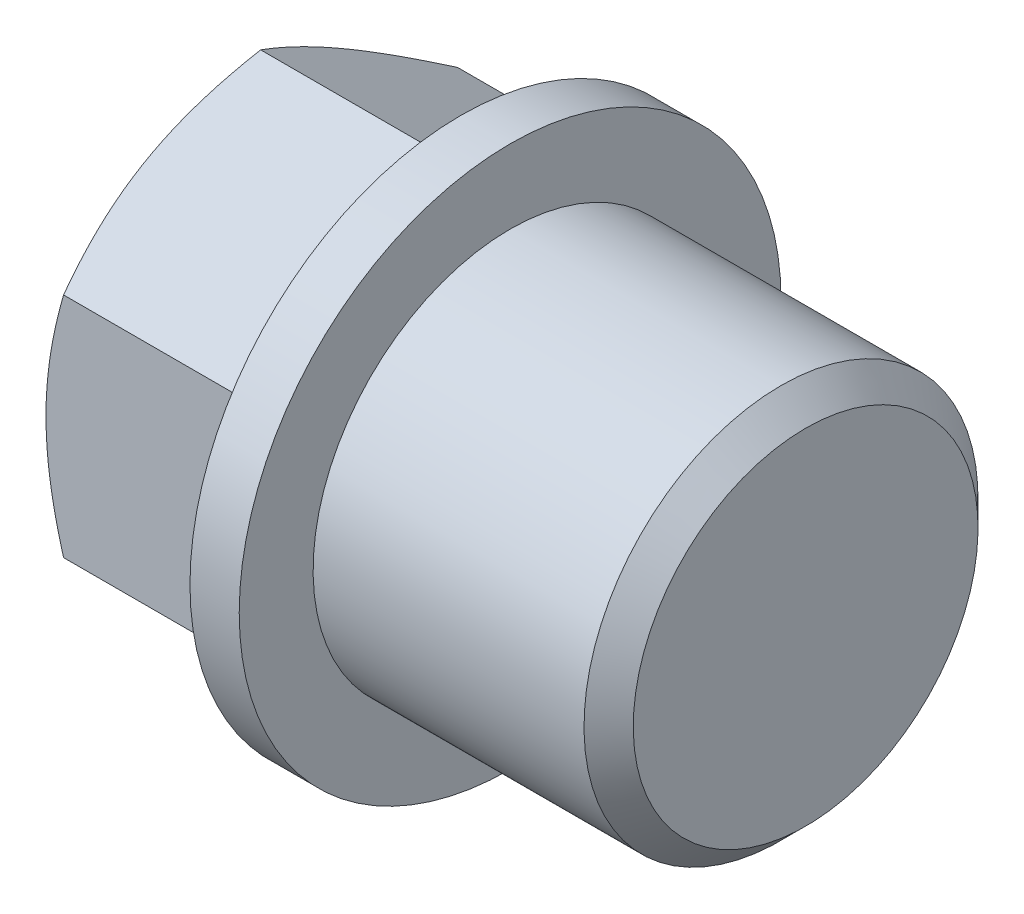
ISO-10303-21;
HEADER;
FILE_DESCRIPTION(('STEP AP214'),'2;1');
FILE_NAME('part.step','',(''),(''),'','','');
FILE_SCHEMA(('AUTOMOTIVE_DESIGN { 1 0 10303 214 1 1 1 1 }'));
ENDSEC;
DATA;
#1=APPLICATION_CONTEXT('core data for automotive mechanical design processes');
#2=APPLICATION_PROTOCOL_DEFINITION('international standard','automotive_design',2000,#1);
#3=PRODUCT_CONTEXT('',#1,'mechanical');
#4=PRODUCT('Part','Part','',(#3));
#5=PRODUCT_RELATED_PRODUCT_CATEGORY('part','',(#4));
#6=PRODUCT_DEFINITION_FORMATION('','',#4);
#7=PRODUCT_DEFINITION_CONTEXT('part definition',#1,'design');
#8=PRODUCT_DEFINITION('design','',#6,#7);
#9=PRODUCT_DEFINITION_SHAPE('','',#8);
#10=(LENGTH_UNIT() NAMED_UNIT(*) SI_UNIT(.MILLI.,.METRE.));
#11=(NAMED_UNIT(*) PLANE_ANGLE_UNIT() SI_UNIT($,.RADIAN.));
#12=(NAMED_UNIT(*) SI_UNIT($,.STERADIAN.) SOLID_ANGLE_UNIT());
#13=UNCERTAINTY_MEASURE_WITH_UNIT(LENGTH_MEASURE(1.E-05),#10,'distance_accuracy_value','');
#14=(GEOMETRIC_REPRESENTATION_CONTEXT(3) GLOBAL_UNCERTAINTY_ASSIGNED_CONTEXT((#13)) GLOBAL_UNIT_ASSIGNED_CONTEXT((#10,
#11,#12)) REPRESENTATION_CONTEXT('',''));
#15=CARTESIAN_POINT('',(0.,0.,0.));
#16=DIRECTION('',(0.,0.,1.));
#17=DIRECTION('',(1.,0.,0.));
#18=AXIS2_PLACEMENT_3D('',#15,#16,#17);
#19=CARTESIAN_POINT('',(10.,9.23759999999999,0.));
#20=DIRECTION('',(0.,0.866025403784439,0.5));
#21=DIRECTION('',(0.,-0.5,0.866025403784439));
#22=AXIS2_PLACEMENT_3D('',#19,#20,#21);
#23=PLANE('',#22);
#24=DIRECTION('',(-1.,0.,0.));
#25=VECTOR('',#24,1.);
#26=CARTESIAN_POINT('',(10.,9.23759999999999,0.));
#27=LINE('',#26,#25);
#28=CARTESIAN_POINT('',(10.,9.23759999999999,0.));
#29=VERTEX_POINT('',#28);
#30=CARTESIAN_POINT('',(1.8692292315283,9.23759999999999,0.));
#31=VERTEX_POINT('',#30);
#32=EDGE_CURVE('E108',#29,#31,#27,.T.);
#33=ORIENTED_EDGE('',*,*,#32,.T.);
#34=CARTESIAN_POINT('',(1.86929589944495,9.23771547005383,-0.000200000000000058));
#35=CARTESIAN_POINT('',(1.81068879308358,9.13618917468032,0.175648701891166));
#36=CARTESIAN_POINT('',(1.75474150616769,9.03428435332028,0.352153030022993));
#37=CARTESIAN_POINT('',(1.64889915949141,8.82964710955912,0.706595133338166));
#38=CARTESIAN_POINT('',(1.5990067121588,8.7269143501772,0.884533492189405));
#39=CARTESIAN_POINT('',(1.45939104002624,8.41707119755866,1.42119757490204));
#40=CARTESIAN_POINT('',(1.3799794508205,8.20873771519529,1.78204175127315));
#41=CARTESIAN_POINT('',(1.28685996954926,7.89697068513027,2.32203808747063));
#42=CARTESIAN_POINT('',(1.26033291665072,7.79446853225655,2.49957702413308));
#43=CARTESIAN_POINT('',(1.21585153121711,7.58900068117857,2.85545778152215));
#44=CARTESIAN_POINT('',(1.19789644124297,7.48603502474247,3.03379952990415));
#45=CARTESIAN_POINT('',(1.17101402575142,7.27992642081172,3.39079010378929));
#46=CARTESIAN_POINT('',(1.16207645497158,7.17678380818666,3.5694383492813));
#47=CARTESIAN_POINT('',(1.15342068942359,6.97040330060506,3.92689987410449));
#48=CARTESIAN_POINT('',(1.15370220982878,6.86716540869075,4.10571314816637));
#49=CARTESIAN_POINT('',(1.1628434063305,6.67415828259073,4.44001129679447));
#50=CARTESIAN_POINT('',(1.1705879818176,6.58437542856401,4.59551976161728));
#51=CARTESIAN_POINT('',(1.19289950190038,6.40502000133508,4.90617247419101));
#52=CARTESIAN_POINT('',(1.20746690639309,6.31544744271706,5.06131669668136));
#53=CARTESIAN_POINT('',(1.26105902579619,6.04707653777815,5.5261487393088));
#54=CARTESIAN_POINT('',(1.30996695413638,5.86875323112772,5.83501376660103));
#55=CARTESIAN_POINT('',(1.4322376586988,5.51021498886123,6.45602021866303));
#56=CARTESIAN_POINT('',(1.50611874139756,5.33004581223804,6.76808238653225));
#57=CARTESIAN_POINT('',(1.67379828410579,4.97239426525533,7.3875530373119));
#58=CARTESIAN_POINT('',(1.76755735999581,4.79490731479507,7.69496945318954));
#59=CARTESIAN_POINT('',(1.86929589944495,4.61868452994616,8.00019626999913));
#60=B_SPLINE_CURVE_WITH_KNOTS('',3,(#34,#35,#36,#37,#38,#39,#40,#41,#42,#43,#44,#45,#46,#47,#48,
#49,#50,#51,#52,#53,#54,#55,#56,#57,#58,#59),.UNSPECIFIED.,.F.,.F.,(4,2,2,2,2,2,2,2,2,2,2,2,4),
(0.,0.633973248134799,1.26821906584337,2.53934594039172,3.15934196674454,3.77928319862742,
4.39851928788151,5.01773624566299,5.5567998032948,6.09589970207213,7.17486742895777,
8.27776464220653,9.37849677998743),.UNSPECIFIED.);
#61=CARTESIAN_POINT('',(1.8692292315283,4.6188,7.99999626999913));
#62=VERTEX_POINT('',#61);
#63=EDGE_CURVE('E48',#31,#62,#60,.T.);
#64=ORIENTED_EDGE('',*,*,#63,.T.);
#65=DIRECTION('',(-1.,0.,0.));
#66=VECTOR('',#65,1.);
#67=CARTESIAN_POINT('',(10.,4.6188,7.99999626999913));
#68=LINE('',#67,#66);
#69=CARTESIAN_POINT('',(10.,4.6188,7.99999626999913));
#70=VERTEX_POINT('',#69);
#71=EDGE_CURVE('E120',#70,#62,#68,.T.);
#72=ORIENTED_EDGE('',*,*,#71,.F.);
#73=DIRECTION('',(0.,0.5,-0.866025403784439));
#74=VECTOR('',#73,1.);
#75=CARTESIAN_POINT('',(10.,9.23759999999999,0.));
#76=LINE('',#75,#74);
#77=EDGE_CURVE('E164',#70,#29,#76,.T.);
#78=ORIENTED_EDGE('',*,*,#77,.T.);
#79=EDGE_LOOP('',(#33,#64,#72,#78));
#80=FACE_BOUND('',#79,.T.);
#81=ADVANCED_FACE('F33',(#80),#23,.T.);
#82=CARTESIAN_POINT('',(10.,4.6188,7.99999626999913));
#83=DIRECTION('',(0.,0.,1.));
#84=DIRECTION('',(1.,0.,0.));
#85=AXIS2_PLACEMENT_3D('',#82,#83,#84);
#86=PLANE('',#85);
#87=ORIENTED_EDGE('',*,*,#71,.T.);
#88=CARTESIAN_POINT('',(4.95442625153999,-12.1907708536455,7.99999626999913));
#89=CARTESIAN_POINT('',(4.7866343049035,-11.8430577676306,7.99999626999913));
#90=CARTESIAN_POINT('',(4.62051521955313,-11.4945227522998,7.99999626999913));
#91=CARTESIAN_POINT('',(4.29256846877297,-10.7953707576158,7.99999626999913));
#92=CARTESIAN_POINT('',(4.13074152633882,-10.4447534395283,7.99999626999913));
#93=CARTESIAN_POINT('',(3.8114639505,-9.73908673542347,7.99999626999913));
#94=CARTESIAN_POINT('',(3.65404392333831,-9.38402345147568,7.99999626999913));
#95=CARTESIAN_POINT('',(3.34594332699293,-8.67099548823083,7.99999626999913));
#96=CARTESIAN_POINT('',(3.19526242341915,-8.31303095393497,7.99999626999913));
#97=CARTESIAN_POINT('',(2.8981204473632,-7.58305066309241,7.99999626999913));
#98=CARTESIAN_POINT('',(2.7519132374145,-7.2109309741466,7.99999626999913));
#99=CARTESIAN_POINT('',(2.47109638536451,-6.46226031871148,7.99999626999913));
#100=CARTESIAN_POINT('',(2.3364880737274,-6.08570884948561,7.99999626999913));
#101=CARTESIAN_POINT('',(2.08256178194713,-5.32834814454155,7.99999626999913));
#102=CARTESIAN_POINT('',(1.96321090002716,-4.94755006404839,7.99999626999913));
#103=CARTESIAN_POINT('',(1.74376789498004,-4.18051264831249,7.99999626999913));
#104=CARTESIAN_POINT('',(1.6436694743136,-3.79427513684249,7.99999626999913));
#105=CARTESIAN_POINT('',(1.46818794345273,-3.01811789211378,7.99999626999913));
#106=CARTESIAN_POINT('',(1.39268275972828,-2.62822654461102,7.99999626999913));
#107=CARTESIAN_POINT('',(1.3012550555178,-2.04001884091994,7.99999626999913));
#108=CARTESIAN_POINT('',(1.27441621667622,-1.84337184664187,7.99999626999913));
#109=CARTESIAN_POINT('',(1.22854574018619,-1.44917566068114,7.99999626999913));
#110=CARTESIAN_POINT('',(1.20951335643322,-1.25162655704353,7.99999626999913));
#111=CARTESIAN_POINT('',(1.17986299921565,-0.858376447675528,7.99999626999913));
#112=CARTESIAN_POINT('',(1.16914292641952,-0.662683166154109,7.99999626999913));
#113=CARTESIAN_POINT('',(1.15596967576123,-0.271019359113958,7.99999626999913));
#114=CARTESIAN_POINT('',(1.15351636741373,-0.0750488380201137,7.99999626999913));
#115=CARTESIAN_POINT('',(1.15693499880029,0.316823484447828,7.99999626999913));
#116=CARTESIAN_POINT('',(1.16280708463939,0.51272528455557,7.99999626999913));
#117=CARTESIAN_POINT('',(1.18273752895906,0.904114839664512,7.99999626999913));
#118=CARTESIAN_POINT('',(1.19679631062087,1.09960257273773,7.99999626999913));
#119=CARTESIAN_POINT('',(1.24075066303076,1.57607769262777,7.99999626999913));
#120=CARTESIAN_POINT('',(1.27489894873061,1.8566791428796,7.99999626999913));
#121=CARTESIAN_POINT('',(1.35814974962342,2.41565676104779,7.99999626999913));
#122=CARTESIAN_POINT('',(1.40725448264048,2.69403259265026,7.99999626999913));
#123=CARTESIAN_POINT('',(1.51867105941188,3.24834070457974,7.99999626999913));
#124=CARTESIAN_POINT('',(1.58099369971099,3.52427079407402,7.99999626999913));
#125=CARTESIAN_POINT('',(1.71695872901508,4.07329575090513,7.99999626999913));
#126=CARTESIAN_POINT('',(1.79060089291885,4.3463906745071,7.99999626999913));
#127=CARTESIAN_POINT('',(1.94917606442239,4.89577736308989,7.99999626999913));
#128=CARTESIAN_POINT('',(2.0343218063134,5.17200730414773,7.99999626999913));
#129=CARTESIAN_POINT('',(2.2129478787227,5.72174427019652,7.99999626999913));
#130=CARTESIAN_POINT('',(2.30642826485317,5.9952512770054,7.99999626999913));
#131=CARTESIAN_POINT('',(2.50027992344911,6.53968696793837,7.99999626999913));
#132=CARTESIAN_POINT('',(2.60064863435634,6.81061656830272,7.99999626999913));
#133=CARTESIAN_POINT('',(2.80714159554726,7.35026061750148,7.99999626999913));
#134=CARTESIAN_POINT('',(2.91326577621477,7.61897509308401,7.99999626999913));
#135=CARTESIAN_POINT('',(3.17236263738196,8.25821612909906,7.99999626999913));
#136=CARTESIAN_POINT('',(3.3275528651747,8.62784259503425,7.99999626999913));
#137=CARTESIAN_POINT('',(3.64515269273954,9.36398983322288,7.99999626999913));
#138=CARTESIAN_POINT('',(3.80756272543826,9.73051041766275,7.99999626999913));
#139=CARTESIAN_POINT('',(4.13813100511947,10.4610390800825,7.99999626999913));
#140=CARTESIAN_POINT('',(4.30629048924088,10.8250465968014,7.99999626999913));
#141=CARTESIAN_POINT('',(4.64718078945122,11.5509001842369,7.99999626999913));
#142=CARTESIAN_POINT('',(4.81991150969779,11.9127463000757,7.99999626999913));
#143=CARTESIAN_POINT('',(5.1692621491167,12.635026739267,7.99999626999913));
#144=CARTESIAN_POINT('',(5.34588599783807,12.995459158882,7.99999626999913));
#145=CARTESIAN_POINT('',(5.70217868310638,13.7148171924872,7.99999626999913));
#146=CARTESIAN_POINT('',(5.88184754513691,14.0737427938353,7.99999626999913));
#147=CARTESIAN_POINT('',(6.42455683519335,15.1485328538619,7.99999626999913));
#148=CARTESIAN_POINT('',(6.79134567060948,15.8625043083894,7.99999626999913));
#149=CARTESIAN_POINT('',(7.50064897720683,17.2266391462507,7.99999626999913));
#150=CARTESIAN_POINT('',(7.84259697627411,17.8770983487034,7.99999626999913));
#151=CARTESIAN_POINT('',(8.53091405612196,19.1757004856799,7.99999626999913));
#152=CARTESIAN_POINT('',(8.87728328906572,19.8238433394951,7.99999626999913));
#153=CARTESIAN_POINT('',(9.57255356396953,21.1167843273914,7.99999626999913));
#154=CARTESIAN_POINT('',(9.92144664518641,21.7615867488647,7.99999626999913));
#155=CARTESIAN_POINT('',(10.621866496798,23.0497162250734,7.99999626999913));
#156=CARTESIAN_POINT('',(10.9733931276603,23.6930433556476,7.99999626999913));
#157=CARTESIAN_POINT('',(11.3259007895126,24.3358289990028,7.99999626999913));
#158=B_SPLINE_CURVE_WITH_KNOTS('',3,(#88,#89,#90,#91,#92,#93,#94,#95,#96,#97,#98,#99,#100,#101,
#102,#103,#104,#105,#106,#107,#108,#109,#110,#111,#112,#113,#114,#115,#116,#117,#118,#119,#120,
#121,#122,#123,#124,#125,#126,#127,#128,#129,#130,#131,#132,#133,#134,#135,#136,#137,#138,#139,
#140,#141,#142,#143,#144,#145,#146,#147,#148,#149,#150,#151,#152,#153,#154,#155,#156,#157),
.UNSPECIFIED.,.F.,.F.,(4,2,2,2,2,2,2,2,2,2,2,2,2,2,2,2,2,2,2,2,2,2,2,2,2,2,2,2,2,2,2,2,2,2,4),
(0.,1.15825820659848,2.31671029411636,3.48184057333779,4.64691297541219,5.84619902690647,
7.04562246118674,8.24241413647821,9.43881366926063,10.6291807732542,11.2244602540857,
11.8196828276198,12.4074731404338,12.9952541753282,13.5830455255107,14.1708672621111,
15.0184086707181,15.8660758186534,16.7144380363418,17.5627833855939,18.4297900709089,
19.2968025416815,20.163494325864,21.0301756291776,22.2327213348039,23.4353392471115,
24.6382175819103,25.8410707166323,27.045199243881,28.2493378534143,30.6573022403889,
32.8618771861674,35.0665282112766,37.2659463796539,39.4652488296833),.UNSPECIFIED.);
#159=CARTESIAN_POINT('',(1.8692292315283,-4.6188,7.99999626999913));
#160=VERTEX_POINT('',#159);
#161=EDGE_CURVE('E165',#62,#160,#158,.F.);
#162=ORIENTED_EDGE('',*,*,#161,.T.);
#163=DIRECTION('',(-1.,0.,0.));
#164=VECTOR('',#163,1.);
#165=CARTESIAN_POINT('',(10.,-4.6188,7.99999626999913));
#166=LINE('',#165,#164);
#167=CARTESIAN_POINT('',(10.,-4.6188,7.99999626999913));
#168=VERTEX_POINT('',#167);
#169=EDGE_CURVE('E313',#168,#160,#166,.T.);
#170=ORIENTED_EDGE('',*,*,#169,.F.);
#171=DIRECTION('',(0.,1.,0.));
#172=VECTOR('',#171,1.);
#173=CARTESIAN_POINT('',(10.,4.6188,7.99999626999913));
#174=LINE('',#173,#172);
#175=EDGE_CURVE('E112',#168,#70,#174,.T.);
#176=ORIENTED_EDGE('',*,*,#175,.T.);
#177=EDGE_LOOP('',(#87,#162,#170,#176));
#178=FACE_BOUND('',#177,.T.);
#179=ADVANCED_FACE('F144',(#178),#86,.T.);
#180=CARTESIAN_POINT('',(10.,-4.6188,7.99999626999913));
#181=DIRECTION('',(0.,-0.866025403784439,0.5));
#182=DIRECTION('',(0.,-0.5,-0.866025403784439));
#183=AXIS2_PLACEMENT_3D('',#180,#181,#182);
#184=PLANE('',#183);
#185=ORIENTED_EDGE('',*,*,#169,.T.);
#186=CARTESIAN_POINT('',(1.86929589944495,-4.61868452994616,8.00019626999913));
#187=CARTESIAN_POINT('',(1.81068879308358,-4.72021082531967,7.82434756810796));
#188=CARTESIAN_POINT('',(1.75474150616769,-4.82211564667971,7.64784323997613));
#189=CARTESIAN_POINT('',(1.64889915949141,-5.02675289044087,7.29340113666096));
#190=CARTESIAN_POINT('',(1.5990067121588,-5.12948564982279,7.11546277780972));
#191=CARTESIAN_POINT('',(1.45939104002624,-5.43932880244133,6.57879869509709));
#192=CARTESIAN_POINT('',(1.3799794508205,-5.6476622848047,6.21795451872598));
#193=CARTESIAN_POINT('',(1.28685996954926,-5.95942931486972,5.6779581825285));
#194=CARTESIAN_POINT('',(1.26033291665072,-6.06193146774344,5.50041924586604));
#195=CARTESIAN_POINT('',(1.21585153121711,-6.26739931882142,5.14453848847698));
#196=CARTESIAN_POINT('',(1.19789644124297,-6.37036497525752,4.96619674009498));
#197=CARTESIAN_POINT('',(1.17101402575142,-6.57647357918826,4.60920616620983));
#198=CARTESIAN_POINT('',(1.16207645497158,-6.67961619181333,4.43055792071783));
#199=CARTESIAN_POINT('',(1.15342068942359,-6.88599669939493,4.07309639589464));
#200=CARTESIAN_POINT('',(1.15370220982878,-6.98923459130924,3.89428312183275));
#201=CARTESIAN_POINT('',(1.1628434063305,-7.18224171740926,3.55998497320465));
#202=CARTESIAN_POINT('',(1.1705879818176,-7.27202457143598,3.40447650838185));
#203=CARTESIAN_POINT('',(1.19289950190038,-7.45137999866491,3.09382379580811));
#204=CARTESIAN_POINT('',(1.20746690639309,-7.54095255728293,2.93867957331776));
#205=CARTESIAN_POINT('',(1.26105902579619,-7.80932346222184,2.47384753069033));
#206=CARTESIAN_POINT('',(1.30996695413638,-7.98764676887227,2.1649825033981));
#207=CARTESIAN_POINT('',(1.4322376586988,-8.34618501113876,1.5439760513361));
#208=CARTESIAN_POINT('',(1.50611874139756,-8.52635418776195,1.23191388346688));
#209=CARTESIAN_POINT('',(1.67379828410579,-8.88400573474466,0.612443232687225));
#210=CARTESIAN_POINT('',(1.76755735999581,-9.06149268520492,0.305026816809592));
#211=CARTESIAN_POINT('',(1.86929589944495,-9.23771547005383,-0.000200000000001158));
#212=B_SPLINE_CURVE_WITH_KNOTS('',3,(#186,#187,#188,#189,#190,#191,#192,#193,#194,#195,#196,
#197,#198,#199,#200,#201,#202,#203,#204,#205,#206,#207,#208,#209,#210,#211),.UNSPECIFIED.,.F.,
.F.,(4,2,2,2,2,2,2,2,2,2,2,2,4),(0.,0.633973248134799,1.26821906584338,2.53934594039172,
3.15934196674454,3.77928319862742,4.3985192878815,5.01773624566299,5.5567998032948,
6.09589970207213,7.17486742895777,8.27776464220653,9.37849677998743),.UNSPECIFIED.);
#213=CARTESIAN_POINT('',(1.8692292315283,-9.23759999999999,0.));
#214=VERTEX_POINT('',#213);
#215=EDGE_CURVE('E191',#160,#214,#212,.T.);
#216=ORIENTED_EDGE('',*,*,#215,.T.);
#217=DIRECTION('',(-1.,0.,0.));
#218=VECTOR('',#217,1.);
#219=CARTESIAN_POINT('',(10.,-9.23759999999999,0.));
#220=LINE('',#219,#218);
#221=CARTESIAN_POINT('',(9.99999999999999,-9.23759999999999,0.));
#222=VERTEX_POINT('',#221);
#223=EDGE_CURVE('E110',#222,#214,#220,.T.);
#224=ORIENTED_EDGE('',*,*,#223,.F.);
#225=DIRECTION('',(0.,0.5,0.866025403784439));
#226=VECTOR('',#225,1.);
#227=CARTESIAN_POINT('',(10.,-4.6188,7.99999626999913));
#228=LINE('',#227,#226);
#229=EDGE_CURVE('E321',#222,#168,#228,.T.);
#230=ORIENTED_EDGE('',*,*,#229,.T.);
#231=EDGE_LOOP('',(#185,#216,#224,#230));
#232=FACE_BOUND('',#231,.T.);
#233=ADVANCED_FACE('F150',(#232),#184,.T.);
#234=CARTESIAN_POINT('',(10.,-4.6188,-7.99999626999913));
#235=DIRECTION('',(0.,-0.866025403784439,-0.5));
#236=DIRECTION('',(0.,0.5,-0.866025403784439));
#237=AXIS2_PLACEMENT_3D('',#234,#235,#236);
#238=PLANE('',#237);
#239=ORIENTED_EDGE('',*,*,#223,.T.);
#240=CARTESIAN_POINT('',(1.86929589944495,-9.23771547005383,0.000200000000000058));
#241=CARTESIAN_POINT('',(1.81068879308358,-9.13618917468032,-0.175648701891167));
#242=CARTESIAN_POINT('',(1.75474150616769,-9.03428435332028,-0.352153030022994));
#243=CARTESIAN_POINT('',(1.64889915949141,-8.82964710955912,-0.706595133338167));
#244=CARTESIAN_POINT('',(1.5990067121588,-8.7269143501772,-0.884533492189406));
#245=CARTESIAN_POINT('',(1.45939104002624,-8.41707119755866,-1.42119757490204));
#246=CARTESIAN_POINT('',(1.3799794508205,-8.20873771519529,-1.78204175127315));
#247=CARTESIAN_POINT('',(1.28685996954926,-7.89697068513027,-2.32203808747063));
#248=CARTESIAN_POINT('',(1.26033291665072,-7.79446853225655,-2.49957702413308));
#249=CARTESIAN_POINT('',(1.21585153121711,-7.58900068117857,-2.85545778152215));
#250=CARTESIAN_POINT('',(1.19789644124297,-7.48603502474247,-3.03379952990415));
#251=CARTESIAN_POINT('',(1.17101402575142,-7.27992642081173,-3.39079010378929));
#252=CARTESIAN_POINT('',(1.16207645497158,-7.17678380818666,-3.5694383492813));
#253=CARTESIAN_POINT('',(1.15342068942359,-6.97040330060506,-3.92689987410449));
#254=CARTESIAN_POINT('',(1.15370220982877,-6.86716540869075,-4.10571314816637));
#255=CARTESIAN_POINT('',(1.1628434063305,-6.67415828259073,-4.44001129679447));
#256=CARTESIAN_POINT('',(1.1705879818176,-6.58437542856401,-4.59551976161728));
#257=CARTESIAN_POINT('',(1.19289950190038,-6.40502000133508,-4.90617247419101));
#258=CARTESIAN_POINT('',(1.20746690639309,-6.31544744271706,-5.06131669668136));
#259=CARTESIAN_POINT('',(1.26105902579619,-6.04707653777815,-5.5261487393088));
#260=CARTESIAN_POINT('',(1.30996695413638,-5.86875323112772,-5.83501376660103));
#261=CARTESIAN_POINT('',(1.4322376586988,-5.51021498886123,-6.45602021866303));
#262=CARTESIAN_POINT('',(1.50611874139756,-5.33004581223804,-6.76808238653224));
#263=CARTESIAN_POINT('',(1.67379828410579,-4.97239426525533,-7.3875530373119));
#264=CARTESIAN_POINT('',(1.76755735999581,-4.79490731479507,-7.69496945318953));
#265=CARTESIAN_POINT('',(1.86929589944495,-4.61868452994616,-8.00019626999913));
#266=B_SPLINE_CURVE_WITH_KNOTS('',3,(#240,#241,#242,#243,#244,#245,#246,#247,#248,#249,#250,
#251,#252,#253,#254,#255,#256,#257,#258,#259,#260,#261,#262,#263,#264,#265),.UNSPECIFIED.,.F.,
.F.,(4,2,2,2,2,2,2,2,2,2,2,2,4),(0.,0.6339732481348,1.26821906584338,2.53934594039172,
3.15934196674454,3.77928319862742,4.3985192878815,5.01773624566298,5.5567998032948,
6.09589970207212,7.17486742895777,8.27776464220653,9.37849677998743),.UNSPECIFIED.);
#267=CARTESIAN_POINT('',(1.8692292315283,-4.6188,-7.99999626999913));
#268=VERTEX_POINT('',#267);
#269=EDGE_CURVE('E103',#214,#268,#266,.T.);
#270=ORIENTED_EDGE('',*,*,#269,.T.);
#271=DIRECTION('',(-1.,0.,0.));
#272=VECTOR('',#271,1.);
#273=CARTESIAN_POINT('',(10.,-4.6188,-7.99999626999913));
#274=LINE('',#273,#272);
#275=CARTESIAN_POINT('',(10.,-4.6188,-7.99999626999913));
#276=VERTEX_POINT('',#275);
#277=EDGE_CURVE('E102',#276,#268,#274,.T.);
#278=ORIENTED_EDGE('',*,*,#277,.F.);
#279=DIRECTION('',(0.,-0.5,0.866025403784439));
#280=VECTOR('',#279,1.);
#281=CARTESIAN_POINT('',(10.,-4.6188,-7.99999626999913));
#282=LINE('',#281,#280);
#283=EDGE_CURVE('E56',#276,#222,#282,.T.);
#284=ORIENTED_EDGE('',*,*,#283,.T.);
#285=EDGE_LOOP('',(#239,#270,#278,#284));
#286=FACE_BOUND('',#285,.T.);
#287=ADVANCED_FACE('F198',(#286),#238,.T.);
#288=CARTESIAN_POINT('',(10.,4.6188,-7.99999626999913));
#289=DIRECTION('',(0.,0.,-1.));
#290=DIRECTION('',(-1.,0.,0.));
#291=AXIS2_PLACEMENT_3D('',#288,#289,#290);
#292=PLANE('',#291);
#293=ORIENTED_EDGE('',*,*,#277,.T.);
#294=CARTESIAN_POINT('',(4.95442625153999,-12.1907708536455,-7.99999626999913));
#295=CARTESIAN_POINT('',(4.7866343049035,-11.8430577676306,-7.99999626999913));
#296=CARTESIAN_POINT('',(4.62051521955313,-11.4945227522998,-7.99999626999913));
#297=CARTESIAN_POINT('',(4.29256846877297,-10.7953707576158,-7.99999626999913));
#298=CARTESIAN_POINT('',(4.13074152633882,-10.4447534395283,-7.99999626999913));
#299=CARTESIAN_POINT('',(3.8114639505,-9.73908673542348,-7.99999626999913));
#300=CARTESIAN_POINT('',(3.65404392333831,-9.38402345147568,-7.99999626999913));
#301=CARTESIAN_POINT('',(3.34594332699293,-8.67099548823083,-7.99999626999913));
#302=CARTESIAN_POINT('',(3.19526242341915,-8.31303095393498,-7.99999626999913));
#303=CARTESIAN_POINT('',(2.8981204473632,-7.58305066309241,-7.99999626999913));
#304=CARTESIAN_POINT('',(2.7519132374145,-7.2109309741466,-7.99999626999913));
#305=CARTESIAN_POINT('',(2.47109638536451,-6.46226031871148,-7.99999626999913));
#306=CARTESIAN_POINT('',(2.3364880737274,-6.08570884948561,-7.99999626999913));
#307=CARTESIAN_POINT('',(2.08256178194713,-5.32834814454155,-7.99999626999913));
#308=CARTESIAN_POINT('',(1.96321090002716,-4.94755006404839,-7.99999626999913));
#309=CARTESIAN_POINT('',(1.74376789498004,-4.18051264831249,-7.99999626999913));
#310=CARTESIAN_POINT('',(1.6436694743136,-3.79427513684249,-7.99999626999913));
#311=CARTESIAN_POINT('',(1.46818794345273,-3.01811789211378,-7.99999626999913));
#312=CARTESIAN_POINT('',(1.39268275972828,-2.62822654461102,-7.99999626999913));
#313=CARTESIAN_POINT('',(1.3012550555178,-2.04001884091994,-7.99999626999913));
#314=CARTESIAN_POINT('',(1.27441621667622,-1.84337184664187,-7.99999626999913));
#315=CARTESIAN_POINT('',(1.22854574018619,-1.44917566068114,-7.99999626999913));
#316=CARTESIAN_POINT('',(1.20951335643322,-1.25162655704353,-7.99999626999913));
#317=CARTESIAN_POINT('',(1.17986299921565,-0.858376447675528,-7.99999626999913));
#318=CARTESIAN_POINT('',(1.16914292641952,-0.662683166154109,-7.99999626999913));
#319=CARTESIAN_POINT('',(1.15596967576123,-0.271019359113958,-7.99999626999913));
#320=CARTESIAN_POINT('',(1.15351636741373,-0.0750488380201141,-7.99999626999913));
#321=CARTESIAN_POINT('',(1.15693499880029,0.316823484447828,-7.99999626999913));
#322=CARTESIAN_POINT('',(1.16280708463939,0.51272528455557,-7.99999626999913));
#323=CARTESIAN_POINT('',(1.18273752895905,0.904114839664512,-7.99999626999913));
#324=CARTESIAN_POINT('',(1.19679631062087,1.09960257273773,-7.99999626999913));
#325=CARTESIAN_POINT('',(1.24075066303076,1.57607769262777,-7.99999626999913));
#326=CARTESIAN_POINT('',(1.27489894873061,1.85667914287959,-7.99999626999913));
#327=CARTESIAN_POINT('',(1.35814974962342,2.41565676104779,-7.99999626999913));
#328=CARTESIAN_POINT('',(1.40725448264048,2.69403259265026,-7.99999626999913));
#329=CARTESIAN_POINT('',(1.51867105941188,3.24834070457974,-7.99999626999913));
#330=CARTESIAN_POINT('',(1.58099369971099,3.52427079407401,-7.99999626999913));
#331=CARTESIAN_POINT('',(1.71695872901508,4.07329575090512,-7.99999626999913));
#332=CARTESIAN_POINT('',(1.79060089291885,4.3463906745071,-7.99999626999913));
#333=CARTESIAN_POINT('',(1.94917606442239,4.89577736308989,-7.99999626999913));
#334=CARTESIAN_POINT('',(2.03432180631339,5.17200730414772,-7.99999626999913));
#335=CARTESIAN_POINT('',(2.2129478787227,5.72174427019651,-7.99999626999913));
#336=CARTESIAN_POINT('',(2.30642826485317,5.99525127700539,-7.99999626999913));
#337=CARTESIAN_POINT('',(2.5002799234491,6.53968696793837,-7.99999626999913));
#338=CARTESIAN_POINT('',(2.60064863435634,6.81061656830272,-7.99999626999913));
#339=CARTESIAN_POINT('',(2.80714159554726,7.35026061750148,-7.99999626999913));
#340=CARTESIAN_POINT('',(2.91326577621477,7.61897509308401,-7.99999626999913));
#341=CARTESIAN_POINT('',(3.17236263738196,8.25821612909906,-7.99999626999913));
#342=CARTESIAN_POINT('',(3.3275528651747,8.62784259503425,-7.99999626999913));
#343=CARTESIAN_POINT('',(3.64515269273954,9.36398983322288,-7.99999626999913));
#344=CARTESIAN_POINT('',(3.80756272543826,9.73051041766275,-7.99999626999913));
#345=CARTESIAN_POINT('',(4.13813100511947,10.4610390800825,-7.99999626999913));
#346=CARTESIAN_POINT('',(4.30629048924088,10.8250465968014,-7.99999626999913));
#347=CARTESIAN_POINT('',(4.64718078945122,11.5509001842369,-7.99999626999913));
#348=CARTESIAN_POINT('',(4.8199115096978,11.9127463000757,-7.99999626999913));
#349=CARTESIAN_POINT('',(5.16926214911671,12.635026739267,-7.99999626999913));
#350=CARTESIAN_POINT('',(5.34588599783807,12.995459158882,-7.99999626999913));
#351=CARTESIAN_POINT('',(5.70217868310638,13.7148171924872,-7.99999626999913));
#352=CARTESIAN_POINT('',(5.88184754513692,14.0737427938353,-7.99999626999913));
#353=CARTESIAN_POINT('',(6.42455683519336,15.1485328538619,-7.99999626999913));
#354=CARTESIAN_POINT('',(6.79134567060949,15.8625043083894,-7.99999626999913));
#355=CARTESIAN_POINT('',(7.50064897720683,17.2266391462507,-7.99999626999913));
#356=CARTESIAN_POINT('',(7.8425969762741,17.8770983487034,-7.99999626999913));
#357=CARTESIAN_POINT('',(8.53091405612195,19.1757004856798,-7.99999626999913));
#358=CARTESIAN_POINT('',(8.87728328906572,19.8238433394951,-7.99999626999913));
#359=CARTESIAN_POINT('',(9.57255356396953,21.1167843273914,-7.99999626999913));
#360=CARTESIAN_POINT('',(9.92144664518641,21.7615867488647,-7.99999626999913));
#361=CARTESIAN_POINT('',(10.621866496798,23.0497162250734,-7.99999626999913));
#362=CARTESIAN_POINT('',(10.9733931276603,23.6930433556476,-7.99999626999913));
#363=CARTESIAN_POINT('',(11.3259007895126,24.3358289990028,-7.99999626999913));
#364=B_SPLINE_CURVE_WITH_KNOTS('',3,(#294,#295,#296,#297,#298,#299,#300,#301,#302,#303,#304,
#305,#306,#307,#308,#309,#310,#311,#312,#313,#314,#315,#316,#317,#318,#319,#320,#321,#322,#323,
#324,#325,#326,#327,#328,#329,#330,#331,#332,#333,#334,#335,#336,#337,#338,#339,#340,#341,#342,
#343,#344,#345,#346,#347,#348,#349,#350,#351,#352,#353,#354,#355,#356,#357,#358,#359,#360,#361,
#362,#363),.UNSPECIFIED.,.F.,.F.,(4,2,2,2,2,2,2,2,2,2,2,2,2,2,2,2,2,2,2,2,2,2,2,2,2,2,2,2,2,2,2,
2,2,2,4),(0.,1.15825820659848,2.31671029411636,3.4818405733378,4.64691297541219,
5.84619902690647,7.04562246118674,8.24241413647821,9.43881366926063,10.6291807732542,
11.2244602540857,11.8196828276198,12.4074731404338,12.9952541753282,13.5830455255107,
14.1708672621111,15.0184086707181,15.8660758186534,16.7144380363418,17.5627833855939,
18.4297900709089,19.2968025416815,20.163494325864,21.0301756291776,22.2327213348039,
23.4353392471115,24.6382175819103,25.8410707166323,27.045199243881,28.2493378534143,
30.6573022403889,32.8618771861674,35.0665282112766,37.2659463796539,39.4652488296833),.UNSPECIFIED.);
#365=CARTESIAN_POINT('',(1.8692292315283,4.6188,-7.99999626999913));
#366=VERTEX_POINT('',#365);
#367=EDGE_CURVE('E88',#268,#366,#364,.T.);
#368=ORIENTED_EDGE('',*,*,#367,.T.);
#369=DIRECTION('',(-1.,0.,0.));
#370=VECTOR('',#369,1.);
#371=CARTESIAN_POINT('',(10.,4.6188,-7.99999626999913));
#372=LINE('',#371,#370);
#373=CARTESIAN_POINT('',(10.,4.6188,-7.99999626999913));
#374=VERTEX_POINT('',#373);
#375=EDGE_CURVE('E100',#374,#366,#372,.T.);
#376=ORIENTED_EDGE('',*,*,#375,.F.);
#377=DIRECTION('',(0.,-1.,0.));
#378=VECTOR('',#377,1.);
#379=CARTESIAN_POINT('',(10.,4.6188,-7.99999626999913));
#380=LINE('',#379,#378);
#381=EDGE_CURVE('E324',#374,#276,#380,.T.);
#382=ORIENTED_EDGE('',*,*,#381,.T.);
#383=EDGE_LOOP('',(#293,#368,#376,#382));
#384=FACE_BOUND('',#383,.T.);
#385=ADVANCED_FACE('F98',(#384),#292,.T.);
#386=CARTESIAN_POINT('',(10.,9.23759999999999,0.));
#387=DIRECTION('',(0.,0.866025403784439,-0.5));
#388=DIRECTION('',(0.,0.5,0.866025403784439));
#389=AXIS2_PLACEMENT_3D('',#386,#387,#388);
#390=PLANE('',#389);
#391=ORIENTED_EDGE('',*,*,#375,.T.);
#392=CARTESIAN_POINT('',(1.86929589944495,4.61868452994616,-8.00019626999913));
#393=CARTESIAN_POINT('',(1.81068879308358,4.72021082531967,-7.82434756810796));
#394=CARTESIAN_POINT('',(1.75474150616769,4.82211564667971,-7.64784323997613));
#395=CARTESIAN_POINT('',(1.64889915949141,5.02675289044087,-7.29340113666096));
#396=CARTESIAN_POINT('',(1.5990067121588,5.12948564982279,-7.11546277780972));
#397=CARTESIAN_POINT('',(1.45939104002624,5.43932880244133,-6.57879869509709));
#398=CARTESIAN_POINT('',(1.3799794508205,5.6476622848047,-6.21795451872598));
#399=CARTESIAN_POINT('',(1.28685996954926,5.95942931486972,-5.6779581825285));
#400=CARTESIAN_POINT('',(1.26033291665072,6.06193146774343,-5.50041924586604));
#401=CARTESIAN_POINT('',(1.21585153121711,6.26739931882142,-5.14453848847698));
#402=CARTESIAN_POINT('',(1.19789644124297,6.37036497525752,-4.96619674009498));
#403=CARTESIAN_POINT('',(1.17101402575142,6.57647357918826,-4.60920616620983));
#404=CARTESIAN_POINT('',(1.16207645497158,6.67961619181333,-4.43055792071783));
#405=CARTESIAN_POINT('',(1.15342068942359,6.88599669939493,-4.07309639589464));
#406=CARTESIAN_POINT('',(1.15370220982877,6.98923459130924,-3.89428312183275));
#407=CARTESIAN_POINT('',(1.1628434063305,7.18224171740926,-3.55998497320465));
#408=CARTESIAN_POINT('',(1.1705879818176,7.27202457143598,-3.40447650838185));
#409=CARTESIAN_POINT('',(1.19289950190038,7.45137999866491,-3.09382379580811));
#410=CARTESIAN_POINT('',(1.20746690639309,7.54095255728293,-2.93867957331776));
#411=CARTESIAN_POINT('',(1.26105902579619,7.80932346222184,-2.47384753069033));
#412=CARTESIAN_POINT('',(1.30996695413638,7.98764676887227,-2.1649825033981));
#413=CARTESIAN_POINT('',(1.4322376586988,8.34618501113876,-1.5439760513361));
#414=CARTESIAN_POINT('',(1.50611874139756,8.52635418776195,-1.23191388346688));
#415=CARTESIAN_POINT('',(1.67379828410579,8.88400573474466,-0.612443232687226));
#416=CARTESIAN_POINT('',(1.76755735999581,9.06149268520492,-0.305026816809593));
#417=CARTESIAN_POINT('',(1.86929589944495,9.23771547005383,0.000200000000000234));
#418=B_SPLINE_CURVE_WITH_KNOTS('',3,(#392,#393,#394,#395,#396,#397,#398,#399,#400,#401,#402,
#403,#404,#405,#406,#407,#408,#409,#410,#411,#412,#413,#414,#415,#416,#417),.UNSPECIFIED.,.F.,
.F.,(4,2,2,2,2,2,2,2,2,2,2,2,4),(0.,0.633973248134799,1.26821906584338,2.53934594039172,
3.15934196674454,3.77928319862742,4.3985192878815,5.01773624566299,5.5567998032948,
6.09589970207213,7.17486742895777,8.27776464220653,9.37849677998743),.UNSPECIFIED.);
#419=EDGE_CURVE('E84',#366,#31,#418,.T.);
#420=ORIENTED_EDGE('',*,*,#419,.T.);
#421=ORIENTED_EDGE('',*,*,#32,.F.);
#422=DIRECTION('',(0.,-0.5,-0.866025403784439));
#423=VECTOR('',#422,1.);
#424=CARTESIAN_POINT('',(10.,9.23759999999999,0.));
#425=LINE('',#424,#423);
#426=EDGE_CURVE('E107',#29,#374,#425,.T.);
#427=ORIENTED_EDGE('',*,*,#426,.T.);
#428=EDGE_LOOP('',(#391,#420,#421,#427));
#429=FACE_BOUND('',#428,.T.);
#430=ADVANCED_FACE('F105',(#429),#390,.T.);
#431=CARTESIAN_POINT('',(24.,7.99999999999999,0.));
#432=DIRECTION('',(1.,0.,0.));
#433=DIRECTION('',(0.,1.,0.));
#434=AXIS2_PLACEMENT_3D('',#431,#432,#433);
#435=PLANE('',#434);
#436=CARTESIAN_POINT('',(24.,0.,0.));
#437=DIRECTION('',(1.,0.,0.));
#438=DIRECTION('',(0.,1.,0.));
#439=AXIS2_PLACEMENT_3D('',#436,#437,#438);
#440=CIRCLE('',#439,7.);
#441=CARTESIAN_POINT('',(24.,7.,0.));
#442=VERTEX_POINT('',#441);
#443=EDGE_CURVE('E41',#442,#442,#440,.T.);
#444=ORIENTED_EDGE('',*,*,#443,.T.);
#445=EDGE_LOOP('',(#444));
#446=FACE_BOUND('',#445,.T.);
#447=ADVANCED_FACE('F128',(#446),#435,.T.);
#448=CARTESIAN_POINT('',(60.8172823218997,0.,0.));
#449=DIRECTION('',(1.,0.,0.));
#450=DIRECTION('',(0.,1.,0.));
#451=AXIS2_PLACEMENT_3D('',#448,#449,#450);
#452=CYLINDRICAL_SURFACE('',#451,7.99999999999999);
#453=CARTESIAN_POINT('',(23.,0.,0.));
#454=DIRECTION('',(1.,0.,0.));
#455=DIRECTION('',(0.,1.,0.));
#456=AXIS2_PLACEMENT_3D('',#453,#454,#455);
#457=CIRCLE('',#456,7.99999999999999);
#458=CARTESIAN_POINT('',(23.,7.99999999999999,0.));
#459=VERTEX_POINT('',#458);
#460=EDGE_CURVE('E12',#459,#459,#457,.F.);
#461=ORIENTED_EDGE('',*,*,#460,.T.);
#462=EDGE_LOOP('',(#461));
#463=FACE_BOUND('',#462,.T.);
#464=CARTESIAN_POINT('',(12.,0.,0.));
#465=DIRECTION('',(1.,0.,0.));
#466=DIRECTION('',(0.,1.,0.));
#467=AXIS2_PLACEMENT_3D('',#464,#465,#466);
#468=CIRCLE('',#467,7.99999999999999);
#469=CARTESIAN_POINT('',(12.,7.99999999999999,0.));
#470=VERTEX_POINT('',#469);
#471=EDGE_CURVE('E123',#470,#470,#468,.T.);
#472=ORIENTED_EDGE('',*,*,#471,.T.);
#473=EDGE_LOOP('',(#472));
#474=FACE_BOUND('',#473,.T.);
#475=ADVANCED_FACE('F210',(#463,#474),#452,.T.);
#476=CARTESIAN_POINT('',(12.,11.,0.));
#477=DIRECTION('',(1.,0.,0.));
#478=DIRECTION('',(0.,1.,0.));
#479=AXIS2_PLACEMENT_3D('',#476,#477,#478);
#480=PLANE('',#479);
#481=CARTESIAN_POINT('',(12.,0.,0.));
#482=DIRECTION('',(1.,0.,0.));
#483=DIRECTION('',(0.,1.,0.));
#484=AXIS2_PLACEMENT_3D('',#481,#482,#483);
#485=CIRCLE('',#484,11.);
#486=CARTESIAN_POINT('',(12.,11.,0.));
#487=VERTEX_POINT('',#486);
#488=EDGE_CURVE('E119',#487,#487,#485,.T.);
#489=ORIENTED_EDGE('',*,*,#488,.T.);
#490=EDGE_LOOP('',(#489));
#491=FACE_BOUND('',#490,.T.);
#492=ORIENTED_EDGE('',*,*,#471,.F.);
#493=EDGE_LOOP('',(#492));
#494=FACE_BOUND('',#493,.T.);
#495=ADVANCED_FACE('F214',(#491,#494),#480,.T.);
#496=CARTESIAN_POINT('',(60.8172823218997,0.,0.));
#497=DIRECTION('',(1.,0.,0.));
#498=DIRECTION('',(0.,1.,0.));
#499=AXIS2_PLACEMENT_3D('',#496,#497,#498);
#500=CYLINDRICAL_SURFACE('',#499,11.);
#501=CARTESIAN_POINT('',(9.99999999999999,0.,0.));
#502=DIRECTION('',(1.,0.,0.));
#503=DIRECTION('',(0.,1.,0.));
#504=AXIS2_PLACEMENT_3D('',#501,#502,#503);
#505=CIRCLE('',#504,11.);
#506=CARTESIAN_POINT('',(9.99999999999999,11.,0.));
#507=VERTEX_POINT('',#506);
#508=EDGE_CURVE('E116',#507,#507,#505,.T.);
#509=ORIENTED_EDGE('',*,*,#508,.T.);
#510=EDGE_LOOP('',(#509));
#511=FACE_BOUND('',#510,.T.);
#512=ORIENTED_EDGE('',*,*,#488,.F.);
#513=EDGE_LOOP('',(#512));
#514=FACE_BOUND('',#513,.T.);
#515=ADVANCED_FACE('F139',(#511,#514),#500,.T.);
#516=CARTESIAN_POINT('',(9.99999999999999,9.23759999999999,0.));
#517=DIRECTION('',(-1.,0.,0.));
#518=DIRECTION('',(0.,-1.,0.));
#519=AXIS2_PLACEMENT_3D('',#516,#517,#518);
#520=PLANE('',#519);
#521=ORIENTED_EDGE('',*,*,#229,.F.);
#522=ORIENTED_EDGE('',*,*,#283,.F.);
#523=ORIENTED_EDGE('',*,*,#381,.F.);
#524=ORIENTED_EDGE('',*,*,#426,.F.);
#525=ORIENTED_EDGE('',*,*,#77,.F.);
#526=ORIENTED_EDGE('',*,*,#175,.F.);
#527=EDGE_LOOP('',(#521,#522,#523,#524,#525,#526));
#528=FACE_BOUND('',#527,.T.);
#529=ORIENTED_EDGE('',*,*,#508,.F.);
#530=EDGE_LOOP('',(#529));
#531=FACE_BOUND('',#530,.T.);
#532=ADVANCED_FACE('F131',(#528,#531),#520,.T.);
#533=CARTESIAN_POINT('',(24.,0.,0.));
#534=DIRECTION('',(-1.,0.,0.));
#535=DIRECTION('',(0.,-1.,0.));
#536=AXIS2_PLACEMENT_3D('',#533,#534,#535);
#537=CONICAL_SURFACE('',#536,7.,0.785398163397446);
#538=ORIENTED_EDGE('',*,*,#460,.F.);
#539=EDGE_LOOP('',(#538));
#540=FACE_BOUND('',#539,.T.);
#541=ORIENTED_EDGE('',*,*,#443,.F.);
#542=EDGE_LOOP('',(#541));
#543=FACE_BOUND('',#542,.T.);
#544=ADVANCED_FACE('F35',(#540,#543),#537,.T.);
#545=CARTESIAN_POINT('',(0.,0.,0.));
#546=DIRECTION('',(1.,0.,0.));
#547=DIRECTION('',(0.,0.,-1.));
#548=AXIS2_PLACEMENT_3D('',#545,#546,#547);
#549=CONICAL_SURFACE('',#548,6.,1.0471975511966);
#550=ORIENTED_EDGE('',*,*,#419,.F.);
#551=ORIENTED_EDGE('',*,*,#367,.F.);
#552=ORIENTED_EDGE('',*,*,#269,.F.);
#553=ORIENTED_EDGE('',*,*,#215,.F.);
#554=ORIENTED_EDGE('',*,*,#161,.F.);
#555=ORIENTED_EDGE('',*,*,#63,.F.);
#556=EDGE_LOOP('',(#550,#551,#552,#553,#554,#555));
#557=FACE_BOUND('',#556,.T.);
#558=CARTESIAN_POINT('',(0.,0.,0.));
#559=DIRECTION('',(-1.,0.,0.));
#560=DIRECTION('',(0.,0.,1.));
#561=AXIS2_PLACEMENT_3D('',#558,#559,#560);
#562=CIRCLE('',#561,6.);
#563=CARTESIAN_POINT('',(0.,0.,6.));
#564=VERTEX_POINT('',#563);
#565=EDGE_CURVE('E93',#564,#564,#562,.T.);
#566=ORIENTED_EDGE('',*,*,#565,.F.);
#567=EDGE_LOOP('',(#566));
#568=FACE_BOUND('',#567,.T.);
#569=ADVANCED_FACE('F86',(#557,#568),#549,.T.);
#570=CARTESIAN_POINT('',(0.,0.,0.));
#571=DIRECTION('',(-1.,0.,0.));
#572=DIRECTION('',(0.,-1.,0.));
#573=AXIS2_PLACEMENT_3D('',#570,#571,#572);
#574=PLANE('',#573);
#575=ORIENTED_EDGE('',*,*,#565,.T.);
#576=EDGE_LOOP('',(#575));
#577=FACE_BOUND('',#576,.T.);
#578=ADVANCED_FACE('F137',(#577),#574,.T.);
#579=CLOSED_SHELL('',(#81,#179,#233,#287,#385,#430,#447,#475,#495,#515,#532,#544,#569,#578));
#580=MANIFOLD_SOLID_BREP('B2',#579);
#581=ADVANCED_BREP_SHAPE_REPRESENTATION('',(#18,#580),#14);
#582=SHAPE_DEFINITION_REPRESENTATION(#9,#581);
ENDSEC;
END-ISO-10303-21;
